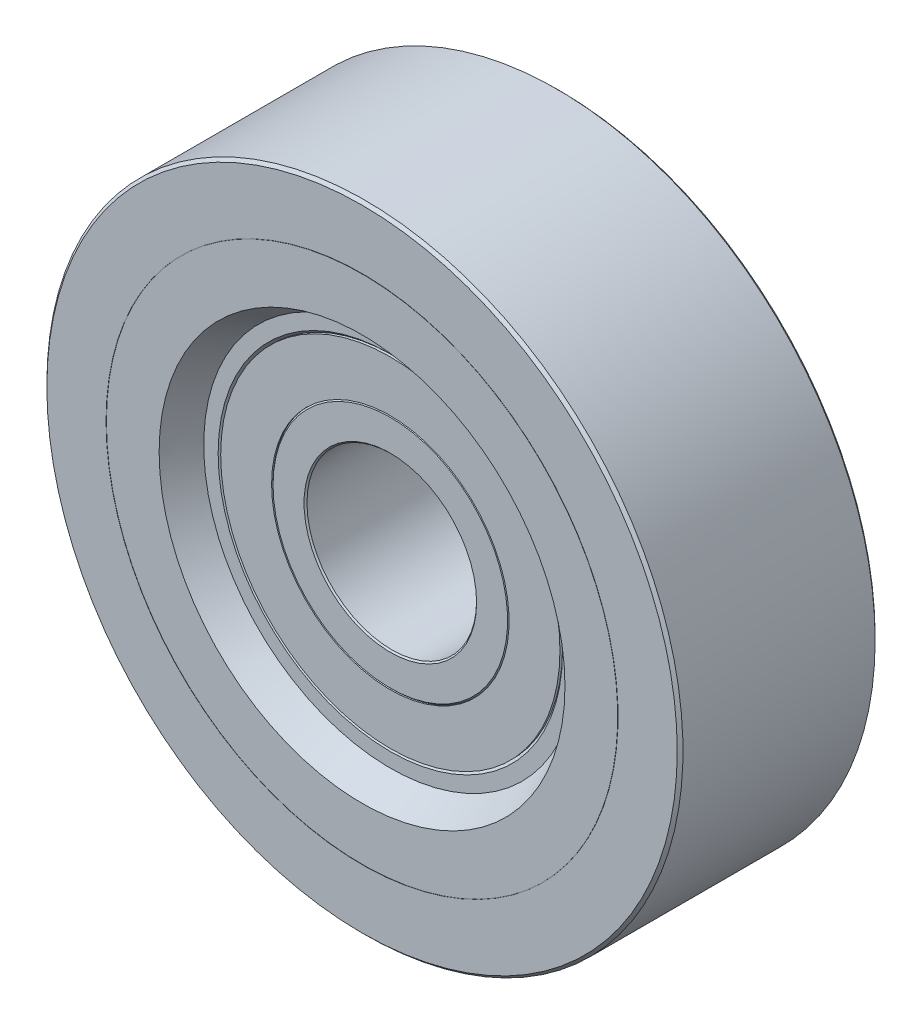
ISO-10303-21;
HEADER;
FILE_DESCRIPTION(('STEP AP214'),'2;1');
FILE_NAME('part.step','',(''),(''),'','','');
FILE_SCHEMA(('AUTOMOTIVE_DESIGN { 1 0 10303 214 1 1 1 1 }'));
ENDSEC;
DATA;
#1=APPLICATION_CONTEXT('core data for automotive mechanical design processes');
#2=APPLICATION_PROTOCOL_DEFINITION('international standard','automotive_design',2000,#1);
#3=PRODUCT_CONTEXT('',#1,'mechanical');
#4=PRODUCT('Part','Part','',(#3));
#5=PRODUCT_RELATED_PRODUCT_CATEGORY('part','',(#4));
#6=PRODUCT_DEFINITION_FORMATION('','',#4);
#7=PRODUCT_DEFINITION_CONTEXT('part definition',#1,'design');
#8=PRODUCT_DEFINITION('design','',#6,#7);
#9=PRODUCT_DEFINITION_SHAPE('','',#8);
#10=(LENGTH_UNIT() NAMED_UNIT(*) SI_UNIT(.MILLI.,.METRE.));
#11=(NAMED_UNIT(*) PLANE_ANGLE_UNIT() SI_UNIT($,.RADIAN.));
#12=(NAMED_UNIT(*) SI_UNIT($,.STERADIAN.) SOLID_ANGLE_UNIT());
#13=UNCERTAINTY_MEASURE_WITH_UNIT(LENGTH_MEASURE(1.E-05),#10,'distance_accuracy_value','');
#14=(GEOMETRIC_REPRESENTATION_CONTEXT(3) GLOBAL_UNCERTAINTY_ASSIGNED_CONTEXT((#13)) GLOBAL_UNIT_ASSIGNED_CONTEXT((#10,
#11,#12)) REPRESENTATION_CONTEXT('',''));
#15=CARTESIAN_POINT('',(0.,0.,0.));
#16=DIRECTION('',(0.,0.,1.));
#17=DIRECTION('',(1.,0.,0.));
#18=AXIS2_PLACEMENT_3D('',#15,#16,#17);
#19=CARTESIAN_POINT('',(0.,0.,4.5));
#20=DIRECTION('',(0.,0.,-1.));
#21=DIRECTION('',(-1.,0.,0.));
#22=AXIS2_PLACEMENT_3D('',#19,#20,#21);
#23=CYLINDRICAL_SURFACE('',#22,12.);
#24=CARTESIAN_POINT('',(0.,0.,5.));
#25=DIRECTION('',(0.,0.,-1.));
#26=DIRECTION('',(-1.,0.,0.));
#27=AXIS2_PLACEMENT_3D('',#24,#25,#26);
#28=CIRCLE('',#27,12.);
#29=CARTESIAN_POINT('',(-12.,0.,5.));
#30=VERTEX_POINT('',#29);
#31=EDGE_CURVE('E183',#30,#30,#28,.T.);
#32=ORIENTED_EDGE('',*,*,#31,.T.);
#33=EDGE_LOOP('',(#32));
#34=FACE_BOUND('',#33,.T.);
#35=CARTESIAN_POINT('',(0.,0.,4.82));
#36=DIRECTION('',(0.,0.,1.));
#37=DIRECTION('',(0.,1.,0.));
#38=AXIS2_PLACEMENT_3D('',#35,#36,#37);
#39=CIRCLE('',#38,12.);
#40=CARTESIAN_POINT('',(0.,12.,4.82));
#41=VERTEX_POINT('',#40);
#42=EDGE_CURVE('E8',#41,#41,#39,.T.);
#43=ORIENTED_EDGE('',*,*,#42,.T.);
#44=EDGE_LOOP('',(#43));
#45=FACE_BOUND('',#44,.T.);
#46=ADVANCED_FACE('F13',(#34,#45),#23,.T.);
#47=CARTESIAN_POINT('',(0.,0.,4.5));
#48=DIRECTION('',(0.,0.,-1.));
#49=DIRECTION('',(-1.,0.,0.));
#50=AXIS2_PLACEMENT_3D('',#47,#48,#49);
#51=CYLINDRICAL_SURFACE('',#50,8.4);
#52=CARTESIAN_POINT('',(0.,0.,4.89693251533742));
#53=DIRECTION('',(0.,0.,-1.));
#54=DIRECTION('',(0.,1.,0.));
#55=AXIS2_PLACEMENT_3D('',#52,#53,#54);
#56=CIRCLE('',#55,8.4);
#57=CARTESIAN_POINT('',(0.,8.4,4.89693251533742));
#58=VERTEX_POINT('',#57);
#59=EDGE_CURVE('E23',#58,#58,#56,.F.);
#60=ORIENTED_EDGE('',*,*,#59,.F.);
#61=EDGE_LOOP('',(#60));
#62=FACE_BOUND('',#61,.T.);
#63=CARTESIAN_POINT('',(0.,0.,5.));
#64=DIRECTION('',(0.,0.,-1.));
#65=DIRECTION('',(-1.,0.,0.));
#66=AXIS2_PLACEMENT_3D('',#63,#64,#65);
#67=CIRCLE('',#66,8.4);
#68=CARTESIAN_POINT('',(-8.4,0.,5.));
#69=VERTEX_POINT('',#68);
#70=EDGE_CURVE('E491',#69,#69,#67,.T.);
#71=ORIENTED_EDGE('',*,*,#70,.F.);
#72=EDGE_LOOP('',(#71));
#73=FACE_BOUND('',#72,.T.);
#74=ADVANCED_FACE('F110',(#62,#73),#51,.F.);
#75=CARTESIAN_POINT('',(0.,10.2,5.));
#76=DIRECTION('',(0.,0.,1.));
#77=DIRECTION('',(1.,0.,0.));
#78=AXIS2_PLACEMENT_3D('',#75,#76,#77);
#79=PLANE('',#78);
#80=ORIENTED_EDGE('',*,*,#31,.F.);
#81=EDGE_LOOP('',(#80));
#82=FACE_BOUND('',#81,.T.);
#83=ORIENTED_EDGE('',*,*,#70,.T.);
#84=EDGE_LOOP('',(#83));
#85=FACE_BOUND('',#84,.T.);
#86=ADVANCED_FACE('F249',(#82,#85),#79,.T.);
#87=CARTESIAN_POINT('',(0.,0.,-6.99));
#88=DIRECTION('',(0.,0.,-1.));
#89=DIRECTION('',(-1.,0.,0.));
#90=AXIS2_PLACEMENT_3D('',#87,#88,#89);
#91=CYLINDRICAL_SURFACE('',#90,18.0885);
#92=CARTESIAN_POINT('',(0.,0.,-6.98));
#93=DIRECTION('',(0.,0.,-1.));
#94=DIRECTION('',(-1.,0.,0.));
#95=AXIS2_PLACEMENT_3D('',#92,#93,#94);
#96=CIRCLE('',#95,18.0885);
#97=CARTESIAN_POINT('',(-18.0885,0.,-6.98));
#98=VERTEX_POINT('',#97);
#99=EDGE_CURVE('E60',#98,#98,#96,.F.);
#100=ORIENTED_EDGE('',*,*,#99,.F.);
#101=EDGE_LOOP('',(#100));
#102=FACE_BOUND('',#101,.T.);
#103=CARTESIAN_POINT('',(0.,0.,-7.));
#104=DIRECTION('',(0.,0.,-1.));
#105=DIRECTION('',(-1.,0.,0.));
#106=AXIS2_PLACEMENT_3D('',#103,#104,#105);
#107=CIRCLE('',#106,18.0885);
#108=CARTESIAN_POINT('',(-18.0885,0.,-7.));
#109=VERTEX_POINT('',#108);
#110=EDGE_CURVE('E66',#109,#109,#107,.F.);
#111=ORIENTED_EDGE('',*,*,#110,.T.);
#112=EDGE_LOOP('',(#111));
#113=FACE_BOUND('',#112,.T.);
#114=ADVANCED_FACE('F245',(#102,#113),#91,.T.);
#115=CARTESIAN_POINT('',(0.,16.2216002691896,-7.));
#116=DIRECTION('',(0.,0.,-1.));
#117=DIRECTION('',(-1.,0.,0.));
#118=AXIS2_PLACEMENT_3D('',#115,#116,#117);
#119=PLANE('',#118);
#120=CARTESIAN_POINT('',(0.,0.,-7.));
#121=DIRECTION('',(0.,0.,-1.));
#122=DIRECTION('',(-1.,0.,0.));
#123=AXIS2_PLACEMENT_3D('',#120,#121,#122);
#124=CIRCLE('',#123,14.3547005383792);
#125=CARTESIAN_POINT('',(-14.3547005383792,0.,-7.));
#126=VERTEX_POINT('',#125);
#127=EDGE_CURVE('E72',#126,#126,#124,.F.);
#128=ORIENTED_EDGE('',*,*,#127,.T.);
#129=EDGE_LOOP('',(#128));
#130=FACE_BOUND('',#129,.T.);
#131=ORIENTED_EDGE('',*,*,#110,.F.);
#132=EDGE_LOOP('',(#131));
#133=FACE_BOUND('',#132,.T.);
#134=ADVANCED_FACE('F248',(#130,#133),#119,.T.);
#135=CARTESIAN_POINT('',(0.,0.,-7.));
#136=DIRECTION('',(0.,0.,-1.));
#137=DIRECTION('',(-1.,0.,0.));
#138=AXIS2_PLACEMENT_3D('',#135,#136,#137);
#139=CONICAL_SURFACE('',#138,14.3547005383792,0.523598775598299);
#140=ORIENTED_EDGE('',*,*,#127,.F.);
#141=EDGE_LOOP('',(#140));
#142=FACE_BOUND('',#141,.T.);
#143=CARTESIAN_POINT('',(0.,0.,-5.));
#144=DIRECTION('',(0.,0.,-1.));
#145=DIRECTION('',(-1.,0.,0.));
#146=AXIS2_PLACEMENT_3D('',#143,#144,#145);
#147=CIRCLE('',#146,13.2);
#148=CARTESIAN_POINT('',(-13.2,0.,-5.));
#149=VERTEX_POINT('',#148);
#150=EDGE_CURVE('E78',#149,#149,#147,.T.);
#151=ORIENTED_EDGE('',*,*,#150,.F.);
#152=EDGE_LOOP('',(#151));
#153=FACE_BOUND('',#152,.T.);
#154=ADVANCED_FACE('F257',(#142,#153),#139,.F.);
#155=CARTESIAN_POINT('',(0.,12.69,-5.));
#156=DIRECTION('',(0.,0.,-1.));
#157=DIRECTION('',(-1.,0.,0.));
#158=AXIS2_PLACEMENT_3D('',#155,#156,#157);
#159=PLANE('',#158);
#160=CARTESIAN_POINT('',(0.,0.,-5.));
#161=DIRECTION('',(0.,0.,-1.));
#162=DIRECTION('',(-1.,0.,0.));
#163=AXIS2_PLACEMENT_3D('',#160,#161,#162);
#164=CIRCLE('',#163,12.18);
#165=CARTESIAN_POINT('',(-12.18,0.,-5.));
#166=VERTEX_POINT('',#165);
#167=EDGE_CURVE('E83',#166,#166,#164,.F.);
#168=ORIENTED_EDGE('',*,*,#167,.T.);
#169=EDGE_LOOP('',(#168));
#170=FACE_BOUND('',#169,.T.);
#171=ORIENTED_EDGE('',*,*,#150,.T.);
#172=EDGE_LOOP('',(#171));
#173=FACE_BOUND('',#172,.T.);
#174=ADVANCED_FACE('F106',(#170,#173),#159,.T.);
#175=CARTESIAN_POINT('',(0.,0.,-5.));
#176=DIRECTION('',(0.,0.,-1.));
#177=DIRECTION('',(-1.,0.,0.));
#178=AXIS2_PLACEMENT_3D('',#175,#176,#177);
#179=CONICAL_SURFACE('',#178,12.18,0.785398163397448);
#180=ORIENTED_EDGE('',*,*,#167,.F.);
#181=EDGE_LOOP('',(#180));
#182=FACE_BOUND('',#181,.T.);
#183=CARTESIAN_POINT('',(0.,0.,-4.82));
#184=DIRECTION('',(0.,0.,-1.));
#185=DIRECTION('',(-1.,0.,0.));
#186=AXIS2_PLACEMENT_3D('',#183,#184,#185);
#187=CIRCLE('',#186,12.);
#188=CARTESIAN_POINT('',(-12.,0.,-4.82));
#189=VERTEX_POINT('',#188);
#190=EDGE_CURVE('E166',#189,#189,#187,.T.);
#191=ORIENTED_EDGE('',*,*,#190,.F.);
#192=EDGE_LOOP('',(#191));
#193=FACE_BOUND('',#192,.T.);
#194=ADVANCED_FACE('F96',(#182,#193),#179,.F.);
#195=CARTESIAN_POINT('',(0.,0.,-4.5));
#196=DIRECTION('',(0.,0.,-1.));
#197=DIRECTION('',(-1.,0.,0.));
#198=AXIS2_PLACEMENT_3D('',#195,#196,#197);
#199=CYLINDRICAL_SURFACE('',#198,12.);
#200=ORIENTED_EDGE('',*,*,#190,.T.);
#201=EDGE_LOOP('',(#200));
#202=FACE_BOUND('',#201,.T.);
#203=CARTESIAN_POINT('',(0.,0.,-5.));
#204=DIRECTION('',(0.,0.,-1.));
#205=DIRECTION('',(-1.,0.,0.));
#206=AXIS2_PLACEMENT_3D('',#203,#204,#205);
#207=CIRCLE('',#206,12.);
#208=CARTESIAN_POINT('',(-12.,0.,-5.));
#209=VERTEX_POINT('',#208);
#210=EDGE_CURVE('E188',#209,#209,#207,.T.);
#211=ORIENTED_EDGE('',*,*,#210,.F.);
#212=EDGE_LOOP('',(#211));
#213=FACE_BOUND('',#212,.T.);
#214=ADVANCED_FACE('F114',(#202,#213),#199,.T.);
#215=CARTESIAN_POINT('',(0.,10.2,-5.));
#216=DIRECTION('',(0.,0.,-1.));
#217=DIRECTION('',(-1.,0.,0.));
#218=AXIS2_PLACEMENT_3D('',#215,#216,#217);
#219=PLANE('',#218);
#220=CARTESIAN_POINT('',(0.,0.,-5.));
#221=DIRECTION('',(0.,0.,-1.));
#222=DIRECTION('',(-1.,0.,0.));
#223=AXIS2_PLACEMENT_3D('',#220,#221,#222);
#224=CIRCLE('',#223,8.4);
#225=CARTESIAN_POINT('',(-8.4,0.,-5.));
#226=VERTEX_POINT('',#225);
#227=EDGE_CURVE('E185',#226,#226,#224,.F.);
#228=ORIENTED_EDGE('',*,*,#227,.T.);
#229=EDGE_LOOP('',(#228));
#230=FACE_BOUND('',#229,.T.);
#231=ORIENTED_EDGE('',*,*,#210,.T.);
#232=EDGE_LOOP('',(#231));
#233=FACE_BOUND('',#232,.T.);
#234=ADVANCED_FACE('F157',(#230,#233),#219,.T.);
#235=CARTESIAN_POINT('',(0.,0.,-4.5));
#236=DIRECTION('',(0.,0.,-1.));
#237=DIRECTION('',(-1.,0.,0.));
#238=AXIS2_PLACEMENT_3D('',#235,#236,#237);
#239=CYLINDRICAL_SURFACE('',#238,8.4);
#240=ORIENTED_EDGE('',*,*,#227,.F.);
#241=EDGE_LOOP('',(#240));
#242=FACE_BOUND('',#241,.T.);
#243=CARTESIAN_POINT('',(0.,0.,-4.89693251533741));
#244=DIRECTION('',(0.,0.,1.));
#245=DIRECTION('',(0.,1.,0.));
#246=AXIS2_PLACEMENT_3D('',#243,#244,#245);
#247=CIRCLE('',#246,8.4);
#248=CARTESIAN_POINT('',(0.,8.4,-4.89693251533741));
#249=VERTEX_POINT('',#248);
#250=EDGE_CURVE('E179',#249,#249,#247,.F.);
#251=ORIENTED_EDGE('',*,*,#250,.F.);
#252=EDGE_LOOP('',(#251));
#253=FACE_BOUND('',#252,.T.);
#254=ADVANCED_FACE('F130',(#242,#253),#239,.F.);
#255=CARTESIAN_POINT('',(0.,0.,-4.89693251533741));
#256=DIRECTION('',(0.,0.,1.));
#257=DIRECTION('',(1.,0.,0.));
#258=AXIS2_PLACEMENT_3D('',#255,#256,#257);
#259=CONICAL_SURFACE('',#258,8.4,0.785398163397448);
#260=ORIENTED_EDGE('',*,*,#250,.T.);
#261=EDGE_LOOP('',(#260));
#262=FACE_BOUND('',#261,.T.);
#263=CARTESIAN_POINT('',(0.,0.,-5.));
#264=DIRECTION('',(0.,0.,1.));
#265=DIRECTION('',(1.,0.,0.));
#266=AXIS2_PLACEMENT_3D('',#263,#264,#265);
#267=CIRCLE('',#266,8.29693251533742);
#268=CARTESIAN_POINT('',(8.29693251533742,0.,-5.));
#269=VERTEX_POINT('',#268);
#270=EDGE_CURVE('E174',#269,#269,#267,.F.);
#271=ORIENTED_EDGE('',*,*,#270,.F.);
#272=EDGE_LOOP('',(#271));
#273=FACE_BOUND('',#272,.T.);
#274=ADVANCED_FACE('F131',(#262,#273),#259,.T.);
#275=CARTESIAN_POINT('',(0.,7.2,-5.));
#276=DIRECTION('',(0.,0.,-1.));
#277=DIRECTION('',(-1.,0.,0.));
#278=AXIS2_PLACEMENT_3D('',#275,#276,#277);
#279=PLANE('',#278);
#280=CARTESIAN_POINT('',(0.,0.,-5.00000000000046));
#281=DIRECTION('',(0.,0.,-1.));
#282=DIRECTION('',(-1.,0.,0.));
#283=AXIS2_PLACEMENT_3D('',#280,#281,#282);
#284=CIRCLE('',#283,6.10306748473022);
#285=CARTESIAN_POINT('',(-6.10306748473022,0.,-5.00000000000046));
#286=VERTEX_POINT('',#285);
#287=EDGE_CURVE('E167',#286,#286,#284,.F.);
#288=ORIENTED_EDGE('',*,*,#287,.T.);
#289=EDGE_LOOP('',(#288));
#290=FACE_BOUND('',#289,.T.);
#291=ORIENTED_EDGE('',*,*,#270,.T.);
#292=EDGE_LOOP('',(#291));
#293=FACE_BOUND('',#292,.T.);
#294=ADVANCED_FACE('F139',(#290,#293),#279,.T.);
#295=CARTESIAN_POINT('',(0.,0.,-5.00000000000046));
#296=DIRECTION('',(0.,0.,-1.));
#297=DIRECTION('',(-1.,0.,0.));
#298=AXIS2_PLACEMENT_3D('',#295,#296,#297);
#299=CONICAL_SURFACE('',#298,6.10306748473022,0.785398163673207);
#300=ORIENTED_EDGE('',*,*,#287,.F.);
#301=EDGE_LOOP('',(#300));
#302=FACE_BOUND('',#301,.T.);
#303=CARTESIAN_POINT('',(0.,0.,-4.8969325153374));
#304=DIRECTION('',(0.,0.,-1.));
#305=DIRECTION('',(-1.,0.,0.));
#306=AXIS2_PLACEMENT_3D('',#303,#304,#305);
#307=CIRCLE('',#306,6.);
#308=CARTESIAN_POINT('',(-6.,0.,-4.8969325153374));
#309=VERTEX_POINT('',#308);
#310=EDGE_CURVE('E184',#309,#309,#307,.F.);
#311=ORIENTED_EDGE('',*,*,#310,.T.);
#312=EDGE_LOOP('',(#311));
#313=FACE_BOUND('',#312,.T.);
#314=ADVANCED_FACE('F324',(#302,#313),#299,.F.);
#315=CARTESIAN_POINT('',(0.,0.,0.));
#316=DIRECTION('',(0.,0.,-1.));
#317=DIRECTION('',(-1.,0.,0.));
#318=AXIS2_PLACEMENT_3D('',#315,#316,#317);
#319=CYLINDRICAL_SURFACE('',#318,6.);
#320=ORIENTED_EDGE('',*,*,#310,.F.);
#321=EDGE_LOOP('',(#320));
#322=FACE_BOUND('',#321,.T.);
#323=CARTESIAN_POINT('',(0.,0.,4.89693251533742));
#324=DIRECTION('',(0.,0.,-1.));
#325=DIRECTION('',(-1.,0.,0.));
#326=AXIS2_PLACEMENT_3D('',#323,#324,#325);
#327=CIRCLE('',#326,6.);
#328=CARTESIAN_POINT('',(-6.,0.,4.89693251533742));
#329=VERTEX_POINT('',#328);
#330=EDGE_CURVE('E170',#329,#329,#327,.T.);
#331=ORIENTED_EDGE('',*,*,#330,.F.);
#332=EDGE_LOOP('',(#331));
#333=FACE_BOUND('',#332,.T.);
#334=ADVANCED_FACE('F132',(#322,#333),#319,.F.);
#335=CARTESIAN_POINT('',(0.,0.,4.99999999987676));
#336=DIRECTION('',(0.,0.,1.));
#337=DIRECTION('',(1.,0.,0.));
#338=AXIS2_PLACEMENT_3D('',#335,#336,#337);
#339=CONICAL_SURFACE('',#338,6.10306748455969,0.785398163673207);
#340=ORIENTED_EDGE('',*,*,#330,.T.);
#341=EDGE_LOOP('',(#340));
#342=FACE_BOUND('',#341,.T.);
#343=CARTESIAN_POINT('',(0.,0.,4.9999999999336));
#344=DIRECTION('',(0.,0.,1.));
#345=DIRECTION('',(1.,0.,0.));
#346=AXIS2_PLACEMENT_3D('',#343,#344,#345);
#347=CIRCLE('',#346,6.10306748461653);
#348=CARTESIAN_POINT('',(6.10306748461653,0.,4.9999999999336));
#349=VERTEX_POINT('',#348);
#350=EDGE_CURVE('E171',#349,#349,#347,.F.);
#351=ORIENTED_EDGE('',*,*,#350,.F.);
#352=EDGE_LOOP('',(#351));
#353=FACE_BOUND('',#352,.T.);
#354=ADVANCED_FACE('F119',(#342,#353),#339,.F.);
#355=CARTESIAN_POINT('',(0.,7.2,5.));
#356=DIRECTION('',(0.,0.,1.));
#357=DIRECTION('',(1.,0.,0.));
#358=AXIS2_PLACEMENT_3D('',#355,#356,#357);
#359=PLANE('',#358);
#360=CARTESIAN_POINT('',(0.,0.,5.));
#361=DIRECTION('',(0.,0.,-1.));
#362=DIRECTION('',(-1.,0.,0.));
#363=AXIS2_PLACEMENT_3D('',#360,#361,#362);
#364=CIRCLE('',#363,8.29693251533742);
#365=CARTESIAN_POINT('',(-8.29693251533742,0.,5.));
#366=VERTEX_POINT('',#365);
#367=EDGE_CURVE('E177',#366,#366,#364,.F.);
#368=ORIENTED_EDGE('',*,*,#367,.T.);
#369=EDGE_LOOP('',(#368));
#370=FACE_BOUND('',#369,.T.);
#371=ORIENTED_EDGE('',*,*,#350,.T.);
#372=EDGE_LOOP('',(#371));
#373=FACE_BOUND('',#372,.T.);
#374=ADVANCED_FACE('F116',(#370,#373),#359,.T.);
#375=CARTESIAN_POINT('',(0.,0.,4.89693251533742));
#376=DIRECTION('',(0.,0.,-1.));
#377=DIRECTION('',(-1.,0.,0.));
#378=AXIS2_PLACEMENT_3D('',#375,#376,#377);
#379=CONICAL_SURFACE('',#378,8.4,0.785398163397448);
#380=ORIENTED_EDGE('',*,*,#367,.F.);
#381=EDGE_LOOP('',(#380));
#382=FACE_BOUND('',#381,.T.);
#383=ORIENTED_EDGE('',*,*,#59,.T.);
#384=EDGE_LOOP('',(#383));
#385=FACE_BOUND('',#384,.T.);
#386=ADVANCED_FACE('F118',(#382,#385),#379,.T.);
#387=CARTESIAN_POINT('',(0.,18.0985,-6.98));
#388=DIRECTION('',(0.,0.,-1.));
#389=DIRECTION('',(-1.,0.,0.));
#390=AXIS2_PLACEMENT_3D('',#387,#388,#389);
#391=PLANE('',#390);
#392=ORIENTED_EDGE('',*,*,#99,.T.);
#393=EDGE_LOOP('',(#392));
#394=FACE_BOUND('',#393,.T.);
#395=CARTESIAN_POINT('',(0.,0.,-6.98));
#396=DIRECTION('',(0.,0.,-1.));
#397=DIRECTION('',(-1.,0.,0.));
#398=AXIS2_PLACEMENT_3D('',#395,#396,#397);
#399=CIRCLE('',#398,18.1085);
#400=CARTESIAN_POINT('',(-18.1085,0.,-6.98));
#401=VERTEX_POINT('',#400);
#402=EDGE_CURVE('E54',#401,#401,#399,.T.);
#403=ORIENTED_EDGE('',*,*,#402,.T.);
#404=EDGE_LOOP('',(#403));
#405=FACE_BOUND('',#404,.T.);
#406=ADVANCED_FACE('F127',(#394,#405),#391,.T.);
#407=CARTESIAN_POINT('',(0.,0.,-6.99));
#408=DIRECTION('',(0.,0.,-1.));
#409=DIRECTION('',(-1.,0.,0.));
#410=AXIS2_PLACEMENT_3D('',#407,#408,#409);
#411=CYLINDRICAL_SURFACE('',#410,18.1085);
#412=CARTESIAN_POINT('',(0.,0.,-7.));
#413=DIRECTION('',(0.,0.,-1.));
#414=DIRECTION('',(-1.,0.,0.));
#415=AXIS2_PLACEMENT_3D('',#412,#413,#414);
#416=CIRCLE('',#415,18.1085);
#417=CARTESIAN_POINT('',(-18.1085,0.,-7.));
#418=VERTEX_POINT('',#417);
#419=EDGE_CURVE('E48',#418,#418,#416,.F.);
#420=ORIENTED_EDGE('',*,*,#419,.F.);
#421=EDGE_LOOP('',(#420));
#422=FACE_BOUND('',#421,.T.);
#423=ORIENTED_EDGE('',*,*,#402,.F.);
#424=EDGE_LOOP('',(#423));
#425=FACE_BOUND('',#424,.T.);
#426=ADVANCED_FACE('F215',(#422,#425),#411,.F.);
#427=CARTESIAN_POINT('',(0.,20.2028986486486,-7.));
#428=DIRECTION('',(0.,0.,-1.));
#429=DIRECTION('',(-1.,0.,0.));
#430=AXIS2_PLACEMENT_3D('',#427,#428,#429);
#431=PLANE('',#430);
#432=ORIENTED_EDGE('',*,*,#419,.T.);
#433=EDGE_LOOP('',(#432));
#434=FACE_BOUND('',#433,.T.);
#435=CARTESIAN_POINT('',(0.,0.,-7.));
#436=DIRECTION('',(0.,0.,1.));
#437=DIRECTION('',(1.,0.,0.));
#438=AXIS2_PLACEMENT_3D('',#435,#436,#437);
#439=CIRCLE('',#438,22.2972972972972);
#440=CARTESIAN_POINT('',(22.2972972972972,0.,-7.));
#441=VERTEX_POINT('',#440);
#442=EDGE_CURVE('E41',#441,#441,#439,.T.);
#443=ORIENTED_EDGE('',*,*,#442,.F.);
#444=EDGE_LOOP('',(#443));
#445=FACE_BOUND('',#444,.T.);
#446=ADVANCED_FACE('F205',(#434,#445),#431,.T.);
#447=CARTESIAN_POINT('',(0.,0.,-6.79729729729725));
#448=DIRECTION('',(0.,0.,1.));
#449=DIRECTION('',(1.,0.,0.));
#450=AXIS2_PLACEMENT_3D('',#447,#448,#449);
#451=CONICAL_SURFACE('',#450,22.5,0.785398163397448);
#452=ORIENTED_EDGE('',*,*,#442,.T.);
#453=EDGE_LOOP('',(#452));
#454=FACE_BOUND('',#453,.T.);
#455=CARTESIAN_POINT('',(0.,0.,-6.7972972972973));
#456=DIRECTION('',(0.,0.,-1.));
#457=DIRECTION('',(-1.,0.,0.));
#458=AXIS2_PLACEMENT_3D('',#455,#456,#457);
#459=CIRCLE('',#458,22.5);
#460=CARTESIAN_POINT('',(-22.5,0.,-6.7972972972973));
#461=VERTEX_POINT('',#460);
#462=EDGE_CURVE('E32',#461,#461,#459,.F.);
#463=ORIENTED_EDGE('',*,*,#462,.F.);
#464=EDGE_LOOP('',(#463));
#465=FACE_BOUND('',#464,.T.);
#466=ADVANCED_FACE('F203',(#454,#465),#451,.T.);
#467=CARTESIAN_POINT('',(0.,0.,0.));
#468=DIRECTION('',(0.,0.,-1.));
#469=DIRECTION('',(-1.,0.,0.));
#470=AXIS2_PLACEMENT_3D('',#467,#468,#469);
#471=CYLINDRICAL_SURFACE('',#470,22.5);
#472=CARTESIAN_POINT('',(0.,0.,6.7972972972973));
#473=DIRECTION('',(0.,0.,-1.));
#474=DIRECTION('',(-1.,0.,0.));
#475=AXIS2_PLACEMENT_3D('',#472,#473,#474);
#476=CIRCLE('',#475,22.5);
#477=CARTESIAN_POINT('',(-22.5,0.,6.7972972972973));
#478=VERTEX_POINT('',#477);
#479=EDGE_CURVE('E44',#478,#478,#476,.T.);
#480=ORIENTED_EDGE('',*,*,#479,.T.);
#481=EDGE_LOOP('',(#480));
#482=FACE_BOUND('',#481,.T.);
#483=ORIENTED_EDGE('',*,*,#462,.T.);
#484=EDGE_LOOP('',(#483));
#485=FACE_BOUND('',#484,.T.);
#486=ADVANCED_FACE('F201',(#482,#485),#471,.T.);
#487=CARTESIAN_POINT('',(0.,0.,6.79729729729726));
#488=DIRECTION('',(0.,0.,-1.));
#489=DIRECTION('',(-1.,0.,0.));
#490=AXIS2_PLACEMENT_3D('',#487,#488,#489);
#491=CONICAL_SURFACE('',#490,22.5,0.785398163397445);
#492=CARTESIAN_POINT('',(0.,0.,7.));
#493=DIRECTION('',(0.,0.,-1.));
#494=DIRECTION('',(-1.,0.,0.));
#495=AXIS2_PLACEMENT_3D('',#492,#493,#494);
#496=CIRCLE('',#495,22.2972972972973);
#497=CARTESIAN_POINT('',(-22.2972972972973,0.,7.));
#498=VERTEX_POINT('',#497);
#499=EDGE_CURVE('E45',#498,#498,#496,.T.);
#500=ORIENTED_EDGE('',*,*,#499,.T.);
#501=EDGE_LOOP('',(#500));
#502=FACE_BOUND('',#501,.T.);
#503=ORIENTED_EDGE('',*,*,#479,.F.);
#504=EDGE_LOOP('',(#503));
#505=FACE_BOUND('',#504,.T.);
#506=ADVANCED_FACE('F208',(#502,#505),#491,.T.);
#507=CARTESIAN_POINT('',(0.,20.2028986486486,7.));
#508=DIRECTION('',(0.,0.,1.));
#509=DIRECTION('',(1.,0.,0.));
#510=AXIS2_PLACEMENT_3D('',#507,#508,#509);
#511=PLANE('',#510);
#512=ORIENTED_EDGE('',*,*,#499,.F.);
#513=EDGE_LOOP('',(#512));
#514=FACE_BOUND('',#513,.T.);
#515=CARTESIAN_POINT('',(0.,0.,7.));
#516=DIRECTION('',(0.,0.,-1.));
#517=DIRECTION('',(-1.,0.,0.));
#518=AXIS2_PLACEMENT_3D('',#515,#516,#517);
#519=CIRCLE('',#518,18.1085);
#520=CARTESIAN_POINT('',(-18.1085,0.,7.));
#521=VERTEX_POINT('',#520);
#522=EDGE_CURVE('E51',#521,#521,#519,.T.);
#523=ORIENTED_EDGE('',*,*,#522,.T.);
#524=EDGE_LOOP('',(#523));
#525=FACE_BOUND('',#524,.T.);
#526=ADVANCED_FACE('F218',(#514,#525),#511,.T.);
#527=CARTESIAN_POINT('',(0.,0.,6.99));
#528=DIRECTION('',(0.,0.,-1.));
#529=DIRECTION('',(-1.,0.,0.));
#530=AXIS2_PLACEMENT_3D('',#527,#528,#529);
#531=CYLINDRICAL_SURFACE('',#530,18.1085);
#532=CARTESIAN_POINT('',(0.,0.,6.98));
#533=DIRECTION('',(0.,0.,-1.));
#534=DIRECTION('',(-1.,0.,0.));
#535=AXIS2_PLACEMENT_3D('',#532,#533,#534);
#536=CIRCLE('',#535,18.1085);
#537=CARTESIAN_POINT('',(-18.1085,0.,6.98));
#538=VERTEX_POINT('',#537);
#539=EDGE_CURVE('E57',#538,#538,#536,.F.);
#540=ORIENTED_EDGE('',*,*,#539,.F.);
#541=EDGE_LOOP('',(#540));
#542=FACE_BOUND('',#541,.T.);
#543=ORIENTED_EDGE('',*,*,#522,.F.);
#544=EDGE_LOOP('',(#543));
#545=FACE_BOUND('',#544,.T.);
#546=ADVANCED_FACE('F226',(#542,#545),#531,.F.);
#547=CARTESIAN_POINT('',(0.,18.0985,6.98));
#548=DIRECTION('',(0.,0.,1.));
#549=DIRECTION('',(1.,0.,0.));
#550=AXIS2_PLACEMENT_3D('',#547,#548,#549);
#551=PLANE('',#550);
#552=ORIENTED_EDGE('',*,*,#539,.T.);
#553=EDGE_LOOP('',(#552));
#554=FACE_BOUND('',#553,.T.);
#555=CARTESIAN_POINT('',(0.,0.,6.98));
#556=DIRECTION('',(0.,0.,-1.));
#557=DIRECTION('',(-1.,0.,0.));
#558=AXIS2_PLACEMENT_3D('',#555,#556,#557);
#559=CIRCLE('',#558,18.0885);
#560=CARTESIAN_POINT('',(-18.0885,0.,6.98));
#561=VERTEX_POINT('',#560);
#562=EDGE_CURVE('E63',#561,#561,#559,.T.);
#563=ORIENTED_EDGE('',*,*,#562,.T.);
#564=EDGE_LOOP('',(#563));
#565=FACE_BOUND('',#564,.T.);
#566=ADVANCED_FACE('F236',(#554,#565),#551,.T.);
#567=CARTESIAN_POINT('',(0.,0.,6.99));
#568=DIRECTION('',(0.,0.,-1.));
#569=DIRECTION('',(-1.,0.,0.));
#570=AXIS2_PLACEMENT_3D('',#567,#568,#569);
#571=CYLINDRICAL_SURFACE('',#570,18.0885);
#572=CARTESIAN_POINT('',(0.,0.,7.));
#573=DIRECTION('',(0.,0.,-1.));
#574=DIRECTION('',(-1.,0.,0.));
#575=AXIS2_PLACEMENT_3D('',#572,#573,#574);
#576=CIRCLE('',#575,18.0885);
#577=CARTESIAN_POINT('',(-18.0885,0.,7.));
#578=VERTEX_POINT('',#577);
#579=EDGE_CURVE('E69',#578,#578,#576,.T.);
#580=ORIENTED_EDGE('',*,*,#579,.T.);
#581=EDGE_LOOP('',(#580));
#582=FACE_BOUND('',#581,.T.);
#583=ORIENTED_EDGE('',*,*,#562,.F.);
#584=EDGE_LOOP('',(#583));
#585=FACE_BOUND('',#584,.T.);
#586=ADVANCED_FACE('F243',(#582,#585),#571,.T.);
#587=CARTESIAN_POINT('',(0.,16.2216002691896,7.));
#588=DIRECTION('',(0.,0.,1.));
#589=DIRECTION('',(1.,0.,0.));
#590=AXIS2_PLACEMENT_3D('',#587,#588,#589);
#591=PLANE('',#590);
#592=ORIENTED_EDGE('',*,*,#579,.F.);
#593=EDGE_LOOP('',(#592));
#594=FACE_BOUND('',#593,.T.);
#595=CARTESIAN_POINT('',(0.,0.,7.));
#596=DIRECTION('',(0.,0.,1.));
#597=DIRECTION('',(1.,0.,0.));
#598=AXIS2_PLACEMENT_3D('',#595,#596,#597);
#599=CIRCLE('',#598,14.3547005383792);
#600=CARTESIAN_POINT('',(14.3547005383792,0.,7.));
#601=VERTEX_POINT('',#600);
#602=EDGE_CURVE('E75',#601,#601,#599,.F.);
#603=ORIENTED_EDGE('',*,*,#602,.T.);
#604=EDGE_LOOP('',(#603));
#605=FACE_BOUND('',#604,.T.);
#606=ADVANCED_FACE('F253',(#594,#605),#591,.T.);
#607=CARTESIAN_POINT('',(0.,0.,7.));
#608=DIRECTION('',(0.,0.,1.));
#609=DIRECTION('',(1.,0.,0.));
#610=AXIS2_PLACEMENT_3D('',#607,#608,#609);
#611=CONICAL_SURFACE('',#610,14.3547005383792,0.523598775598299);
#612=CARTESIAN_POINT('',(0.,0.,5.));
#613=DIRECTION('',(0.,0.,1.));
#614=DIRECTION('',(1.,0.,0.));
#615=AXIS2_PLACEMENT_3D('',#612,#613,#614);
#616=CIRCLE('',#615,13.2);
#617=CARTESIAN_POINT('',(13.2,0.,5.));
#618=VERTEX_POINT('',#617);
#619=EDGE_CURVE('E81',#618,#618,#616,.T.);
#620=ORIENTED_EDGE('',*,*,#619,.F.);
#621=EDGE_LOOP('',(#620));
#622=FACE_BOUND('',#621,.T.);
#623=ORIENTED_EDGE('',*,*,#602,.F.);
#624=EDGE_LOOP('',(#623));
#625=FACE_BOUND('',#624,.T.);
#626=ADVANCED_FACE('F103',(#622,#625),#611,.F.);
#627=CARTESIAN_POINT('',(0.,12.69,5.));
#628=DIRECTION('',(0.,0.,1.));
#629=DIRECTION('',(1.,0.,0.));
#630=AXIS2_PLACEMENT_3D('',#627,#628,#629);
#631=PLANE('',#630);
#632=ORIENTED_EDGE('',*,*,#619,.T.);
#633=EDGE_LOOP('',(#632));
#634=FACE_BOUND('',#633,.T.);
#635=CARTESIAN_POINT('',(0.,0.,5.));
#636=DIRECTION('',(0.,0.,1.));
#637=DIRECTION('',(1.,0.,0.));
#638=AXIS2_PLACEMENT_3D('',#635,#636,#637);
#639=CIRCLE('',#638,12.18);
#640=CARTESIAN_POINT('',(12.18,0.,5.));
#641=VERTEX_POINT('',#640);
#642=EDGE_CURVE('E18',#641,#641,#639,.F.);
#643=ORIENTED_EDGE('',*,*,#642,.T.);
#644=EDGE_LOOP('',(#643));
#645=FACE_BOUND('',#644,.T.);
#646=ADVANCED_FACE('F90',(#634,#645),#631,.T.);
#647=CARTESIAN_POINT('',(0.,0.,5.));
#648=DIRECTION('',(0.,0.,1.));
#649=DIRECTION('',(1.,0.,0.));
#650=AXIS2_PLACEMENT_3D('',#647,#648,#649);
#651=CONICAL_SURFACE('',#650,12.18,0.785398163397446);
#652=ORIENTED_EDGE('',*,*,#42,.F.);
#653=EDGE_LOOP('',(#652));
#654=FACE_BOUND('',#653,.T.);
#655=ORIENTED_EDGE('',*,*,#642,.F.);
#656=EDGE_LOOP('',(#655));
#657=FACE_BOUND('',#656,.T.);
#658=ADVANCED_FACE('F92',(#654,#657),#651,.F.);
#659=CLOSED_SHELL('',(#46,#74,#86,#114,#134,#154,#174,#194,#214,#234,#254,#274,#294,#314,#334,
#354,#374,#386,#406,#426,#446,#466,#486,#506,#526,#546,#566,#586,#606,#626,#646,#658));
#660=CARTESIAN_POINT('',(0.,0.,3.14818048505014));
#661=DIRECTION('',(0.,0.,-1.));
#662=DIRECTION('',(-1.,0.,0.));
#663=AXIS2_PLACEMENT_3D('',#660,#661,#662);
#664=CYLINDRICAL_SURFACE('',#663,8.4);
#665=CARTESIAN_POINT('',(0.,0.,4.));
#666=DIRECTION('',(0.,0.,-1.));
#667=DIRECTION('',(-1.,0.,0.));
#668=AXIS2_PLACEMENT_3D('',#665,#666,#667);
#669=CIRCLE('',#668,8.4);
#670=CARTESIAN_POINT('',(-8.4,0.,4.));
#671=VERTEX_POINT('',#670);
#672=EDGE_CURVE('E28',#671,#671,#669,.F.);
#673=ORIENTED_EDGE('',*,*,#672,.F.);
#674=EDGE_LOOP('',(#673));
#675=FACE_BOUND('',#674,.T.);
#676=CARTESIAN_POINT('',(0.,0.,1.39942845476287));
#677=DIRECTION('',(0.,0.,-1.));
#678=DIRECTION('',(-1.,0.,0.));
#679=AXIS2_PLACEMENT_3D('',#676,#677,#678);
#680=CIRCLE('',#679,8.4);
#681=CARTESIAN_POINT('',(-8.4,0.,1.39942845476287));
#682=VERTEX_POINT('',#681);
#683=EDGE_CURVE('E163',#682,#682,#680,.F.);
#684=ORIENTED_EDGE('',*,*,#683,.T.);
#685=EDGE_LOOP('',(#684));
#686=FACE_BOUND('',#685,.T.);
#687=ADVANCED_FACE('F150',(#675,#686),#664,.T.);
#688=CARTESIAN_POINT('',(0.,0.,0.));
#689=DIRECTION('',(0.,0.,1.));
#690=DIRECTION('',(1.,0.,0.));
#691=AXIS2_PLACEMENT_3D('',#688,#689,#690);
#692=TOROIDAL_SURFACE('',#691,10.2,2.28);
#693=ORIENTED_EDGE('',*,*,#683,.F.);
#694=EDGE_LOOP('',(#693));
#695=FACE_BOUND('',#694,.T.);
#696=CARTESIAN_POINT('',(0.,0.,-1.39942845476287));
#697=DIRECTION('',(0.,0.,-1.));
#698=DIRECTION('',(-1.,0.,0.));
#699=AXIS2_PLACEMENT_3D('',#696,#697,#698);
#700=CIRCLE('',#699,8.4);
#701=CARTESIAN_POINT('',(-8.4,0.,-1.39942845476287));
#702=VERTEX_POINT('',#701);
#703=EDGE_CURVE('E162',#702,#702,#700,.T.);
#704=ORIENTED_EDGE('',*,*,#703,.F.);
#705=EDGE_LOOP('',(#704));
#706=FACE_BOUND('',#705,.T.);
#707=ADVANCED_FACE('F147',(#695,#706),#692,.F.);
#708=CARTESIAN_POINT('',(0.,0.,-3.1481804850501));
#709=DIRECTION('',(0.,0.,-1.));
#710=DIRECTION('',(-1.,0.,0.));
#711=AXIS2_PLACEMENT_3D('',#708,#709,#710);
#712=CYLINDRICAL_SURFACE('',#711,8.4);
#713=ORIENTED_EDGE('',*,*,#703,.T.);
#714=EDGE_LOOP('',(#713));
#715=FACE_BOUND('',#714,.T.);
#716=CARTESIAN_POINT('',(0.,0.,-4.));
#717=DIRECTION('',(0.,0.,1.));
#718=DIRECTION('',(1.,0.,0.));
#719=AXIS2_PLACEMENT_3D('',#716,#717,#718);
#720=CIRCLE('',#719,8.4);
#721=CARTESIAN_POINT('',(8.4,0.,-4.));
#722=VERTEX_POINT('',#721);
#723=EDGE_CURVE('E180',#722,#722,#720,.F.);
#724=ORIENTED_EDGE('',*,*,#723,.F.);
#725=EDGE_LOOP('',(#724));
#726=FACE_BOUND('',#725,.T.);
#727=ADVANCED_FACE('F143',(#715,#726),#712,.T.);
#728=CARTESIAN_POINT('',(0.,0.,3.10971422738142));
#729=DIRECTION('',(0.,0.,-1.));
#730=DIRECTION('',(-1.,0.,0.));
#731=AXIS2_PLACEMENT_3D('',#728,#729,#730);
#732=CYLINDRICAL_SURFACE('',#731,12.);
#733=CARTESIAN_POINT('',(0.,0.,1.39942845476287));
#734=DIRECTION('',(0.,0.,-1.));
#735=DIRECTION('',(-1.,0.,0.));
#736=AXIS2_PLACEMENT_3D('',#733,#734,#735);
#737=CIRCLE('',#736,12.);
#738=CARTESIAN_POINT('',(-12.,0.,1.39942845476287));
#739=VERTEX_POINT('',#738);
#740=EDGE_CURVE('E37',#739,#739,#737,.F.);
#741=ORIENTED_EDGE('',*,*,#740,.F.);
#742=EDGE_LOOP('',(#741));
#743=FACE_BOUND('',#742,.T.);
#744=CARTESIAN_POINT('',(0.,0.,4.));
#745=DIRECTION('',(0.,0.,-1.));
#746=DIRECTION('',(-1.,0.,0.));
#747=AXIS2_PLACEMENT_3D('',#744,#745,#746);
#748=CIRCLE('',#747,12.);
#749=CARTESIAN_POINT('',(-12.,0.,4.));
#750=VERTEX_POINT('',#749);
#751=EDGE_CURVE('E489',#750,#750,#748,.T.);
#752=ORIENTED_EDGE('',*,*,#751,.F.);
#753=EDGE_LOOP('',(#752));
#754=FACE_BOUND('',#753,.T.);
#755=ADVANCED_FACE('F146',(#743,#754),#732,.F.);
#756=CARTESIAN_POINT('',(0.,0.,0.));
#757=DIRECTION('',(0.,0.,1.));
#758=DIRECTION('',(1.,0.,0.));
#759=AXIS2_PLACEMENT_3D('',#756,#757,#758);
#760=TOROIDAL_SURFACE('',#759,10.2,2.28);
#761=ORIENTED_EDGE('',*,*,#740,.T.);
#762=EDGE_LOOP('',(#761));
#763=FACE_BOUND('',#762,.T.);
#764=CARTESIAN_POINT('',(0.,0.,-1.39942845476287));
#765=DIRECTION('',(0.,0.,-1.));
#766=DIRECTION('',(-1.,0.,0.));
#767=AXIS2_PLACEMENT_3D('',#764,#765,#766);
#768=CIRCLE('',#767,12.);
#769=CARTESIAN_POINT('',(-12.,0.,-1.39942845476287));
#770=VERTEX_POINT('',#769);
#771=EDGE_CURVE('E34',#770,#770,#768,.T.);
#772=ORIENTED_EDGE('',*,*,#771,.T.);
#773=EDGE_LOOP('',(#772));
#774=FACE_BOUND('',#773,.T.);
#775=ADVANCED_FACE('F15',(#763,#774),#760,.F.);
#776=CARTESIAN_POINT('',(0.,0.,-3.1097142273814));
#777=DIRECTION('',(0.,0.,-1.));
#778=DIRECTION('',(-1.,0.,0.));
#779=AXIS2_PLACEMENT_3D('',#776,#777,#778);
#780=CYLINDRICAL_SURFACE('',#779,12.);
#781=CARTESIAN_POINT('',(0.,0.,-4.));
#782=DIRECTION('',(0.,0.,-1.));
#783=DIRECTION('',(-1.,0.,0.));
#784=AXIS2_PLACEMENT_3D('',#781,#782,#783);
#785=CIRCLE('',#784,12.);
#786=CARTESIAN_POINT('',(-12.,0.,-4.));
#787=VERTEX_POINT('',#786);
#788=EDGE_CURVE('E191',#787,#787,#785,.T.);
#789=ORIENTED_EDGE('',*,*,#788,.T.);
#790=EDGE_LOOP('',(#789));
#791=FACE_BOUND('',#790,.T.);
#792=ORIENTED_EDGE('',*,*,#771,.F.);
#793=EDGE_LOOP('',(#792));
#794=FACE_BOUND('',#793,.T.);
#795=ADVANCED_FACE('F481',(#791,#794),#780,.F.);
#796=CARTESIAN_POINT('',(0.,10.2,-4.));
#797=DIRECTION('',(0.,0.,1.));
#798=DIRECTION('',(1.,0.,0.));
#799=AXIS2_PLACEMENT_3D('',#796,#797,#798);
#800=PLANE('',#799);
#801=ORIENTED_EDGE('',*,*,#788,.F.);
#802=EDGE_LOOP('',(#801));
#803=FACE_BOUND('',#802,.T.);
#804=ORIENTED_EDGE('',*,*,#723,.T.);
#805=EDGE_LOOP('',(#804));
#806=FACE_BOUND('',#805,.T.);
#807=ADVANCED_FACE('F476',(#803,#806),#800,.T.);
#808=CARTESIAN_POINT('',(0.,10.2,4.));
#809=DIRECTION('',(0.,0.,-1.));
#810=DIRECTION('',(-1.,0.,0.));
#811=AXIS2_PLACEMENT_3D('',#808,#809,#810);
#812=PLANE('',#811);
#813=ORIENTED_EDGE('',*,*,#672,.T.);
#814=EDGE_LOOP('',(#813));
#815=FACE_BOUND('',#814,.T.);
#816=ORIENTED_EDGE('',*,*,#751,.T.);
#817=EDGE_LOOP('',(#816));
#818=FACE_BOUND('',#817,.T.);
#819=ADVANCED_FACE('F474',(#815,#818),#812,.T.);
#820=CLOSED_SHELL('',(#687,#707,#727,#755,#775,#795,#807,#819));
#821=ORIENTED_CLOSED_SHELL('',*,#820,.T.);
#822=BREP_WITH_VOIDS('B1',#659,(#821));
#823=ADVANCED_BREP_SHAPE_REPRESENTATION('',(#18,#822),#14);
#824=SHAPE_DEFINITION_REPRESENTATION(#9,#823);
ENDSEC;
END-ISO-10303-21;
